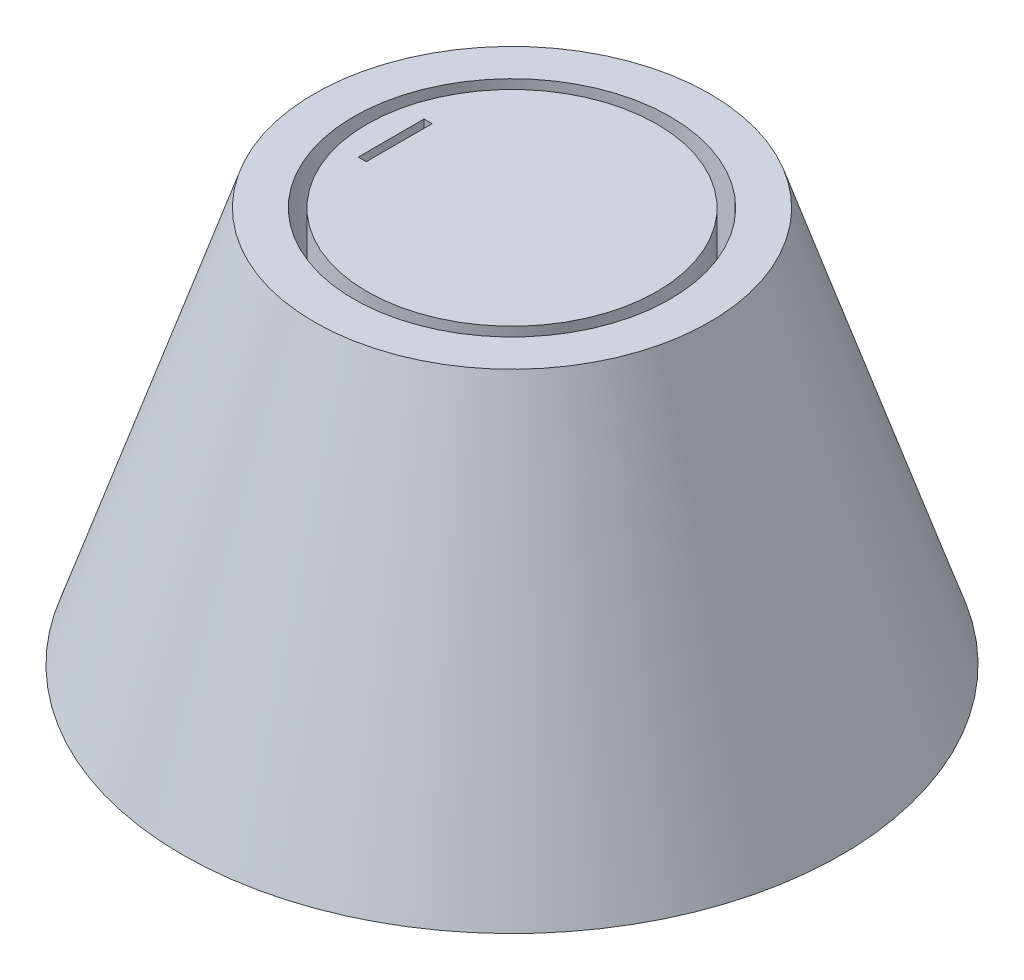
ISO-10303-21;
HEADER;
FILE_DESCRIPTION(('STEP AP214'),'2;1');
FILE_NAME('part.step','',(''),(''),'','','');
FILE_SCHEMA(('AUTOMOTIVE_DESIGN { 1 0 10303 214 1 1 1 1 }'));
ENDSEC;
DATA;
#1=APPLICATION_CONTEXT('core data for automotive mechanical design processes');
#2=APPLICATION_PROTOCOL_DEFINITION('international standard','automotive_design',2000,#1);
#3=PRODUCT_CONTEXT('',#1,'mechanical');
#4=PRODUCT('Part','Part','',(#3));
#5=PRODUCT_RELATED_PRODUCT_CATEGORY('part','',(#4));
#6=PRODUCT_DEFINITION_FORMATION('','',#4);
#7=PRODUCT_DEFINITION_CONTEXT('part definition',#1,'design');
#8=PRODUCT_DEFINITION('design','',#6,#7);
#9=PRODUCT_DEFINITION_SHAPE('','',#8);
#10=(LENGTH_UNIT() NAMED_UNIT(*) SI_UNIT(.MILLI.,.METRE.));
#11=(NAMED_UNIT(*) PLANE_ANGLE_UNIT() SI_UNIT($,.RADIAN.));
#12=(NAMED_UNIT(*) SI_UNIT($,.STERADIAN.) SOLID_ANGLE_UNIT());
#13=UNCERTAINTY_MEASURE_WITH_UNIT(LENGTH_MEASURE(1.E-05),#10,'distance_accuracy_value','');
#14=(GEOMETRIC_REPRESENTATION_CONTEXT(3) GLOBAL_UNCERTAINTY_ASSIGNED_CONTEXT((#13)) GLOBAL_UNIT_ASSIGNED_CONTEXT((#10,
#11,#12)) REPRESENTATION_CONTEXT('',''));
#15=CARTESIAN_POINT('',(0.,0.,0.));
#16=DIRECTION('',(0.,0.,1.));
#17=DIRECTION('',(1.,0.,0.));
#18=AXIS2_PLACEMENT_3D('',#15,#16,#17);
#19=CARTESIAN_POINT('',(0.,0.,0.));
#20=DIRECTION('',(0.,-1.,0.));
#21=DIRECTION('',(0.,0.,-1.));
#22=AXIS2_PLACEMENT_3D('',#19,#20,#21);
#23=PLANE('',#22);
#24=CARTESIAN_POINT('',(0.,0.,0.));
#25=DIRECTION('',(0.,-1.,0.));
#26=DIRECTION('',(0.,0.,-1.));
#27=AXIS2_PLACEMENT_3D('',#24,#25,#26);
#28=CIRCLE('',#27,11.);
#29=CARTESIAN_POINT('',(0.,0.,-11.));
#30=VERTEX_POINT('',#29);
#31=EDGE_CURVE('E11',#30,#30,#28,.T.);
#32=ORIENTED_EDGE('',*,*,#31,.F.);
#33=EDGE_LOOP('',(#32));
#34=FACE_BOUND('',#33,.T.);
#35=DIRECTION('',(0.,0.,1.));
#36=VECTOR('',#35,1.);
#37=CARTESIAN_POINT('',(-8.56,0.,0.));
#38=LINE('',#37,#36);
#39=CARTESIAN_POINT('',(-8.56,0.,-2.5));
#40=VERTEX_POINT('',#39);
#41=CARTESIAN_POINT('',(-8.56,0.,2.5));
#42=VERTEX_POINT('',#41);
#43=EDGE_CURVE('E53',#40,#42,#38,.T.);
#44=ORIENTED_EDGE('',*,*,#43,.T.);
#45=DIRECTION('',(1.,0.,0.));
#46=VECTOR('',#45,1.);
#47=CARTESIAN_POINT('',(0.,0.,2.49999999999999));
#48=LINE('',#47,#46);
#49=CARTESIAN_POINT('',(-9.17,0.,2.5));
#50=VERTEX_POINT('',#49);
#51=EDGE_CURVE('E110',#50,#42,#48,.T.);
#52=ORIENTED_EDGE('',*,*,#51,.F.);
#53=DIRECTION('',(0.,0.,1.));
#54=VECTOR('',#53,1.);
#55=CARTESIAN_POINT('',(-9.17,0.,0.));
#56=LINE('',#55,#54);
#57=CARTESIAN_POINT('',(-9.17,0.,-2.5));
#58=VERTEX_POINT('',#57);
#59=EDGE_CURVE('E108',#58,#50,#56,.T.);
#60=ORIENTED_EDGE('',*,*,#59,.F.);
#61=DIRECTION('',(1.,0.,0.));
#62=VECTOR('',#61,1.);
#63=CARTESIAN_POINT('',(0.,0.,-2.5));
#64=LINE('',#63,#62);
#65=EDGE_CURVE('E85',#58,#40,#64,.T.);
#66=ORIENTED_EDGE('',*,*,#65,.T.);
#67=EDGE_LOOP('',(#44,#52,#60,#66));
#68=FACE_BOUND('',#67,.T.);
#69=ADVANCED_FACE('F39',(#34,#68),#23,.F.);
#70=CARTESIAN_POINT('',(0.,-30.,0.));
#71=DIRECTION('',(0.,-1.,0.));
#72=DIRECTION('',(0.,0.,-1.));
#73=AXIS2_PLACEMENT_3D('',#70,#71,#72);
#74=CYLINDRICAL_SURFACE('',#73,11.);
#75=CARTESIAN_POINT('',(0.,-10.,0.));
#76=DIRECTION('',(0.,-1.,0.));
#77=DIRECTION('',(0.,0.,-1.));
#78=AXIS2_PLACEMENT_3D('',#75,#76,#77);
#79=CIRCLE('',#78,11.);
#80=CARTESIAN_POINT('',(0.,-10.,-11.));
#81=VERTEX_POINT('',#80);
#82=EDGE_CURVE('E46',#81,#81,#79,.T.);
#83=ORIENTED_EDGE('',*,*,#82,.F.);
#84=EDGE_LOOP('',(#83));
#85=FACE_BOUND('',#84,.T.);
#86=ORIENTED_EDGE('',*,*,#31,.T.);
#87=EDGE_LOOP('',(#86));
#88=FACE_BOUND('',#87,.T.);
#89=ADVANCED_FACE('F131',(#85,#88),#74,.T.);
#90=CARTESIAN_POINT('',(-11.,-10.,0.));
#91=DIRECTION('',(0.,-1.,0.));
#92=DIRECTION('',(0.,0.,-1.));
#93=AXIS2_PLACEMENT_3D('',#90,#91,#92);
#94=PLANE('',#93);
#95=CARTESIAN_POINT('',(0.,-10.,0.));
#96=DIRECTION('',(0.,-1.,0.));
#97=DIRECTION('',(0.,0.,-1.));
#98=AXIS2_PLACEMENT_3D('',#95,#96,#97);
#99=CIRCLE('',#98,12.);
#100=CARTESIAN_POINT('',(0.,-10.,-12.));
#101=VERTEX_POINT('',#100);
#102=EDGE_CURVE('E124',#101,#101,#99,.T.);
#103=ORIENTED_EDGE('',*,*,#102,.F.);
#104=EDGE_LOOP('',(#103));
#105=FACE_BOUND('',#104,.T.);
#106=ORIENTED_EDGE('',*,*,#82,.T.);
#107=EDGE_LOOP('',(#106));
#108=FACE_BOUND('',#107,.T.);
#109=ADVANCED_FACE('F129',(#105,#108),#94,.F.);
#110=CARTESIAN_POINT('',(0.,-30.,0.));
#111=DIRECTION('',(0.,-1.,0.));
#112=DIRECTION('',(0.,0.,-1.));
#113=AXIS2_PLACEMENT_3D('',#110,#111,#112);
#114=CYLINDRICAL_SURFACE('',#113,12.);
#115=CARTESIAN_POINT('',(0.,0.,0.));
#116=DIRECTION('',(0.,-1.,0.));
#117=DIRECTION('',(0.,0.,-1.));
#118=AXIS2_PLACEMENT_3D('',#115,#116,#117);
#119=CIRCLE('',#118,12.);
#120=CARTESIAN_POINT('',(0.,0.,-12.));
#121=VERTEX_POINT('',#120);
#122=EDGE_CURVE('E121',#121,#121,#119,.T.);
#123=ORIENTED_EDGE('',*,*,#122,.F.);
#124=EDGE_LOOP('',(#123));
#125=FACE_BOUND('',#124,.T.);
#126=ORIENTED_EDGE('',*,*,#102,.T.);
#127=EDGE_LOOP('',(#126));
#128=FACE_BOUND('',#127,.T.);
#129=ADVANCED_FACE('F165',(#125,#128),#114,.F.);
#130=CARTESIAN_POINT('',(-12.,0.,0.));
#131=DIRECTION('',(0.,-1.,0.));
#132=DIRECTION('',(0.,0.,-1.));
#133=AXIS2_PLACEMENT_3D('',#130,#131,#132);
#134=PLANE('',#133);
#135=CARTESIAN_POINT('',(0.,0.,0.));
#136=DIRECTION('',(0.,-1.,0.));
#137=DIRECTION('',(0.,0.,-1.));
#138=AXIS2_PLACEMENT_3D('',#135,#136,#137);
#139=CIRCLE('',#138,15.);
#140=CARTESIAN_POINT('',(0.,0.,-15.));
#141=VERTEX_POINT('',#140);
#142=EDGE_CURVE('E118',#141,#141,#139,.T.);
#143=ORIENTED_EDGE('',*,*,#142,.F.);
#144=EDGE_LOOP('',(#143));
#145=FACE_BOUND('',#144,.T.);
#146=ORIENTED_EDGE('',*,*,#122,.T.);
#147=EDGE_LOOP('',(#146));
#148=FACE_BOUND('',#147,.T.);
#149=ADVANCED_FACE('F161',(#145,#148),#134,.F.);
#150=CARTESIAN_POINT('',(0.,0.,0.));
#151=DIRECTION('',(0.,-1.,0.));
#152=DIRECTION('',(0.,0.,-1.));
#153=AXIS2_PLACEMENT_3D('',#150,#151,#152);
#154=CONICAL_SURFACE('',#153,15.,0.321750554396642);
#155=CARTESIAN_POINT('',(0.,-30.,0.));
#156=DIRECTION('',(0.,-1.,0.));
#157=DIRECTION('',(0.,0.,-1.));
#158=AXIS2_PLACEMENT_3D('',#155,#156,#157);
#159=CIRCLE('',#158,25.);
#160=CARTESIAN_POINT('',(0.,-30.,-25.));
#161=VERTEX_POINT('',#160);
#162=EDGE_CURVE('E113',#161,#161,#159,.T.);
#163=ORIENTED_EDGE('',*,*,#162,.F.);
#164=EDGE_LOOP('',(#163));
#165=FACE_BOUND('',#164,.T.);
#166=ORIENTED_EDGE('',*,*,#142,.T.);
#167=EDGE_LOOP('',(#166));
#168=FACE_BOUND('',#167,.T.);
#169=ADVANCED_FACE('F157',(#165,#168),#154,.T.);
#170=CARTESIAN_POINT('',(-25.,-30.,0.));
#171=DIRECTION('',(0.,1.,0.));
#172=DIRECTION('',(0.,0.,1.));
#173=AXIS2_PLACEMENT_3D('',#170,#171,#172);
#174=PLANE('',#173);
#175=ORIENTED_EDGE('',*,*,#162,.T.);
#176=EDGE_LOOP('',(#175));
#177=FACE_BOUND('',#176,.T.);
#178=ADVANCED_FACE('F149',(#177),#174,.F.);
#179=CARTESIAN_POINT('',(-8.56,-10.,0.));
#180=DIRECTION('',(-1.,0.,0.));
#181=DIRECTION('',(0.,0.,1.));
#182=AXIS2_PLACEMENT_3D('',#179,#180,#181);
#183=PLANE('',#182);
#184=ORIENTED_EDGE('',*,*,#43,.F.);
#185=DIRECTION('',(0.,1.,0.));
#186=VECTOR('',#185,1.);
#187=CARTESIAN_POINT('',(-8.56,-10.,-2.5));
#188=LINE('',#187,#186);
#189=CARTESIAN_POINT('',(-8.56,-10.,-2.5));
#190=VERTEX_POINT('',#189);
#191=EDGE_CURVE('E91',#190,#40,#188,.T.);
#192=ORIENTED_EDGE('',*,*,#191,.F.);
#193=DIRECTION('',(0.,0.,1.));
#194=VECTOR('',#193,1.);
#195=CARTESIAN_POINT('',(-8.56,-10.,0.));
#196=LINE('',#195,#194);
#197=CARTESIAN_POINT('',(-8.56,-10.,2.5));
#198=VERTEX_POINT('',#197);
#199=EDGE_CURVE('E59',#190,#198,#196,.T.);
#200=ORIENTED_EDGE('',*,*,#199,.T.);
#201=DIRECTION('',(0.,1.,0.));
#202=VECTOR('',#201,1.);
#203=CARTESIAN_POINT('',(-8.56,-10.,2.5));
#204=LINE('',#203,#202);
#205=EDGE_CURVE('E73',#198,#42,#204,.T.);
#206=ORIENTED_EDGE('',*,*,#205,.T.);
#207=EDGE_LOOP('',(#184,#192,#200,#206));
#208=FACE_BOUND('',#207,.T.);
#209=ADVANCED_FACE('F142',(#208),#183,.T.);
#210=CARTESIAN_POINT('',(0.,-10.,2.49999999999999));
#211=DIRECTION('',(0.,0.,1.));
#212=DIRECTION('',(1.,0.,0.));
#213=AXIS2_PLACEMENT_3D('',#210,#211,#212);
#214=PLANE('',#213);
#215=ORIENTED_EDGE('',*,*,#51,.T.);
#216=ORIENTED_EDGE('',*,*,#205,.F.);
#217=DIRECTION('',(1.,0.,0.));
#218=VECTOR('',#217,1.);
#219=CARTESIAN_POINT('',(0.,-10.,2.49999999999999));
#220=LINE('',#219,#218);
#221=CARTESIAN_POINT('',(-9.17,-10.,2.5));
#222=VERTEX_POINT('',#221);
#223=EDGE_CURVE('E101',#222,#198,#220,.T.);
#224=ORIENTED_EDGE('',*,*,#223,.F.);
#225=DIRECTION('',(0.,1.,0.));
#226=VECTOR('',#225,1.);
#227=CARTESIAN_POINT('',(-9.17,-10.,2.5));
#228=LINE('',#227,#226);
#229=EDGE_CURVE('E90',#222,#50,#228,.T.);
#230=ORIENTED_EDGE('',*,*,#229,.T.);
#231=EDGE_LOOP('',(#215,#216,#224,#230));
#232=FACE_BOUND('',#231,.T.);
#233=ADVANCED_FACE('F140',(#232),#214,.F.);
#234=CARTESIAN_POINT('',(-9.17,-10.,0.));
#235=DIRECTION('',(-1.,0.,0.));
#236=DIRECTION('',(0.,0.,1.));
#237=AXIS2_PLACEMENT_3D('',#234,#235,#236);
#238=PLANE('',#237);
#239=ORIENTED_EDGE('',*,*,#59,.T.);
#240=ORIENTED_EDGE('',*,*,#229,.F.);
#241=DIRECTION('',(0.,0.,1.));
#242=VECTOR('',#241,1.);
#243=CARTESIAN_POINT('',(-9.17,-10.,0.));
#244=LINE('',#243,#242);
#245=CARTESIAN_POINT('',(-9.17,-10.,-2.5));
#246=VERTEX_POINT('',#245);
#247=EDGE_CURVE('E97',#246,#222,#244,.T.);
#248=ORIENTED_EDGE('',*,*,#247,.F.);
#249=DIRECTION('',(0.,1.,0.));
#250=VECTOR('',#249,1.);
#251=CARTESIAN_POINT('',(-9.17,-10.,-2.5));
#252=LINE('',#251,#250);
#253=EDGE_CURVE('E82',#246,#58,#252,.T.);
#254=ORIENTED_EDGE('',*,*,#253,.T.);
#255=EDGE_LOOP('',(#239,#240,#248,#254));
#256=FACE_BOUND('',#255,.T.);
#257=ADVANCED_FACE('F100',(#256),#238,.F.);
#258=CARTESIAN_POINT('',(0.,-10.,-2.5));
#259=DIRECTION('',(0.,0.,1.));
#260=DIRECTION('',(1.,0.,0.));
#261=AXIS2_PLACEMENT_3D('',#258,#259,#260);
#262=PLANE('',#261);
#263=ORIENTED_EDGE('',*,*,#65,.F.);
#264=ORIENTED_EDGE('',*,*,#253,.F.);
#265=DIRECTION('',(1.,0.,0.));
#266=VECTOR('',#265,1.);
#267=CARTESIAN_POINT('',(0.,-10.,-2.5));
#268=LINE('',#267,#266);
#269=EDGE_CURVE('E80',#246,#190,#268,.T.);
#270=ORIENTED_EDGE('',*,*,#269,.T.);
#271=ORIENTED_EDGE('',*,*,#191,.T.);
#272=EDGE_LOOP('',(#263,#264,#270,#271));
#273=FACE_BOUND('',#272,.T.);
#274=ADVANCED_FACE('F83',(#273),#262,.T.);
#275=CARTESIAN_POINT('',(0.,-10.,0.));
#276=DIRECTION('',(0.,1.,0.));
#277=DIRECTION('',(0.,0.,1.));
#278=AXIS2_PLACEMENT_3D('',#275,#276,#277);
#279=PLANE('',#278);
#280=ORIENTED_EDGE('',*,*,#199,.F.);
#281=ORIENTED_EDGE('',*,*,#269,.F.);
#282=ORIENTED_EDGE('',*,*,#247,.T.);
#283=ORIENTED_EDGE('',*,*,#223,.T.);
#284=EDGE_LOOP('',(#280,#281,#282,#283));
#285=FACE_BOUND('',#284,.T.);
#286=ADVANCED_FACE('F95',(#285),#279,.T.);
#287=CLOSED_SHELL('',(#69,#89,#109,#129,#149,#169,#178,#209,#233,#257,#274,#286));
#288=MANIFOLD_SOLID_BREP('B2',#287);
#289=ADVANCED_BREP_SHAPE_REPRESENTATION('',(#18,#288),#14);
#290=SHAPE_DEFINITION_REPRESENTATION(#9,#289);
ENDSEC;
END-ISO-10303-21;
